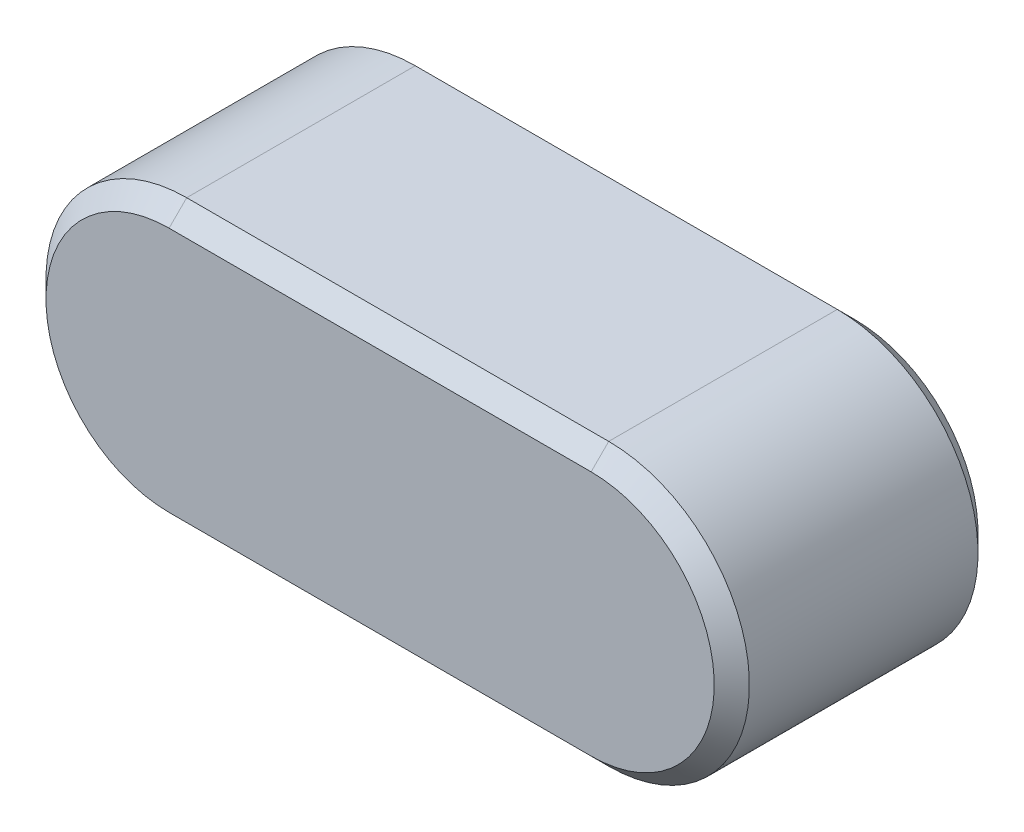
ISO-10303-21;
HEADER;
FILE_DESCRIPTION(('STEP AP214'),'2;1');
FILE_NAME('part.step','',(''),(''),'','','');
FILE_SCHEMA(('AUTOMOTIVE_DESIGN { 1 0 10303 214 1 1 1 1 }'));
ENDSEC;
DATA;
#1=APPLICATION_CONTEXT('core data for automotive mechanical design processes');
#2=APPLICATION_PROTOCOL_DEFINITION('international standard','automotive_design',2000,#1);
#3=PRODUCT_CONTEXT('',#1,'mechanical');
#4=PRODUCT('Part','Part','',(#3));
#5=PRODUCT_RELATED_PRODUCT_CATEGORY('part','',(#4));
#6=PRODUCT_DEFINITION_FORMATION('','',#4);
#7=PRODUCT_DEFINITION_CONTEXT('part definition',#1,'design');
#8=PRODUCT_DEFINITION('design','',#6,#7);
#9=PRODUCT_DEFINITION_SHAPE('','',#8);
#10=(LENGTH_UNIT() NAMED_UNIT(*) SI_UNIT(.MILLI.,.METRE.));
#11=(NAMED_UNIT(*) PLANE_ANGLE_UNIT() SI_UNIT($,.RADIAN.));
#12=(NAMED_UNIT(*) SI_UNIT($,.STERADIAN.) SOLID_ANGLE_UNIT());
#13=UNCERTAINTY_MEASURE_WITH_UNIT(LENGTH_MEASURE(1.E-05),#10,'distance_accuracy_value','');
#14=(GEOMETRIC_REPRESENTATION_CONTEXT(3) GLOBAL_UNCERTAINTY_ASSIGNED_CONTEXT((#13)) GLOBAL_UNIT_ASSIGNED_CONTEXT((#10,
#11,#12)) REPRESENTATION_CONTEXT('',''));
#15=CARTESIAN_POINT('',(0.,0.,0.));
#16=DIRECTION('',(0.,0.,1.));
#17=DIRECTION('',(1.,0.,0.));
#18=AXIS2_PLACEMENT_3D('',#15,#16,#17);
#19=CARTESIAN_POINT('',(-23.8409640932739,0.,7.5));
#20=DIRECTION('',(0.,0.,-1.));
#21=DIRECTION('',(-1.,0.,0.));
#22=AXIS2_PLACEMENT_3D('',#19,#20,#21);
#23=CYLINDRICAL_SURFACE('',#22,4.);
#24=DIRECTION('',(0.,0.,-1.));
#25=VECTOR('',#24,1.);
#26=CARTESIAN_POINT('',(-23.8409640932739,4.,7.5));
#27=LINE('',#26,#25);
#28=CARTESIAN_POINT('',(-23.8409640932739,4.,7.));
#29=VERTEX_POINT('',#28);
#30=CARTESIAN_POINT('',(-23.8409640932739,4.,0.500000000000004));
#31=VERTEX_POINT('',#30);
#32=EDGE_CURVE('E155',#29,#31,#27,.T.);
#33=ORIENTED_EDGE('',*,*,#32,.T.);
#34=CARTESIAN_POINT('',(-23.8409640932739,0.,0.500000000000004));
#35=DIRECTION('',(0.,0.,1.));
#36=DIRECTION('',(1.,0.,0.));
#37=AXIS2_PLACEMENT_3D('',#34,#35,#36);
#38=CIRCLE('',#37,4.);
#39=CARTESIAN_POINT('',(-23.8409640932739,-4.,0.500000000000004));
#40=VERTEX_POINT('',#39);
#41=EDGE_CURVE('E179',#31,#40,#38,.T.);
#42=ORIENTED_EDGE('',*,*,#41,.T.);
#43=DIRECTION('',(0.,0.,-1.));
#44=VECTOR('',#43,1.);
#45=CARTESIAN_POINT('',(-23.8409640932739,-4.,7.5));
#46=LINE('',#45,#44);
#47=CARTESIAN_POINT('',(-23.8409640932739,-4.,7.));
#48=VERTEX_POINT('',#47);
#49=EDGE_CURVE('E124',#48,#40,#46,.T.);
#50=ORIENTED_EDGE('',*,*,#49,.F.);
#51=CARTESIAN_POINT('',(-23.8409640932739,0.,7.));
#52=DIRECTION('',(0.,0.,1.));
#53=DIRECTION('',(1.,0.,0.));
#54=AXIS2_PLACEMENT_3D('',#51,#52,#53);
#55=CIRCLE('',#54,4.);
#56=EDGE_CURVE('E177',#48,#29,#55,.F.);
#57=ORIENTED_EDGE('',*,*,#56,.T.);
#58=EDGE_LOOP('',(#33,#42,#50,#57));
#59=FACE_BOUND('',#58,.T.);
#60=ADVANCED_FACE('F33',(#59),#23,.T.);
#61=CARTESIAN_POINT('',(-23.8409640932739,-4.,7.5));
#62=DIRECTION('',(0.,1.,0.));
#63=DIRECTION('',(-1.,0.,0.));
#64=AXIS2_PLACEMENT_3D('',#61,#62,#63);
#65=PLANE('',#64);
#66=ORIENTED_EDGE('',*,*,#49,.T.);
#67=DIRECTION('',(1.,0.,0.));
#68=VECTOR('',#67,1.);
#69=CARTESIAN_POINT('',(-23.8409640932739,-4.,0.500000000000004));
#70=LINE('',#69,#68);
#71=CARTESIAN_POINT('',(-11.8409640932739,-4.,0.500000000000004));
#72=VERTEX_POINT('',#71);
#73=EDGE_CURVE('E123',#40,#72,#70,.T.);
#74=ORIENTED_EDGE('',*,*,#73,.T.);
#75=DIRECTION('',(0.,0.,-1.));
#76=VECTOR('',#75,1.);
#77=CARTESIAN_POINT('',(-11.8409640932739,-4.,7.5));
#78=LINE('',#77,#76);
#79=CARTESIAN_POINT('',(-11.8409640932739,-4.,7.));
#80=VERTEX_POINT('',#79);
#81=EDGE_CURVE('E106',#80,#72,#78,.T.);
#82=ORIENTED_EDGE('',*,*,#81,.F.);
#83=DIRECTION('',(-1.,0.,0.));
#84=VECTOR('',#83,1.);
#85=CARTESIAN_POINT('',(-23.8409640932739,-4.,7.));
#86=LINE('',#85,#84);
#87=EDGE_CURVE('E120',#80,#48,#86,.T.);
#88=ORIENTED_EDGE('',*,*,#87,.T.);
#89=EDGE_LOOP('',(#66,#74,#82,#88));
#90=FACE_BOUND('',#89,.T.);
#91=ADVANCED_FACE('F119',(#90),#65,.F.);
#92=CARTESIAN_POINT('',(-11.8409640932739,0.,7.5));
#93=DIRECTION('',(0.,0.,-1.));
#94=DIRECTION('',(-1.,0.,0.));
#95=AXIS2_PLACEMENT_3D('',#92,#93,#94);
#96=CYLINDRICAL_SURFACE('',#95,4.);
#97=ORIENTED_EDGE('',*,*,#81,.T.);
#98=CARTESIAN_POINT('',(-11.8409640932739,0.,0.500000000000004));
#99=DIRECTION('',(0.,0.,1.));
#100=DIRECTION('',(1.,0.,0.));
#101=AXIS2_PLACEMENT_3D('',#98,#99,#100);
#102=CIRCLE('',#101,4.);
#103=CARTESIAN_POINT('',(-11.8409640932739,4.,0.500000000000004));
#104=VERTEX_POINT('',#103);
#105=EDGE_CURVE('E112',#72,#104,#102,.T.);
#106=ORIENTED_EDGE('',*,*,#105,.T.);
#107=DIRECTION('',(0.,0.,-1.));
#108=VECTOR('',#107,1.);
#109=CARTESIAN_POINT('',(-11.8409640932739,4.,7.5));
#110=LINE('',#109,#108);
#111=CARTESIAN_POINT('',(-11.8409640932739,4.,7.));
#112=VERTEX_POINT('',#111);
#113=EDGE_CURVE('E108',#112,#104,#110,.T.);
#114=ORIENTED_EDGE('',*,*,#113,.F.);
#115=CARTESIAN_POINT('',(-11.8409640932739,0.,7.));
#116=DIRECTION('',(0.,0.,1.));
#117=DIRECTION('',(1.,0.,0.));
#118=AXIS2_PLACEMENT_3D('',#115,#116,#117);
#119=CIRCLE('',#118,4.);
#120=EDGE_CURVE('E103',#112,#80,#119,.F.);
#121=ORIENTED_EDGE('',*,*,#120,.T.);
#122=EDGE_LOOP('',(#97,#106,#114,#121));
#123=FACE_BOUND('',#122,.T.);
#124=ADVANCED_FACE('F105',(#123),#96,.T.);
#125=CARTESIAN_POINT('',(-23.8409640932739,4.,7.5));
#126=DIRECTION('',(0.,-1.,0.));
#127=DIRECTION('',(1.,0.,0.));
#128=AXIS2_PLACEMENT_3D('',#125,#126,#127);
#129=PLANE('',#128);
#130=ORIENTED_EDGE('',*,*,#113,.T.);
#131=DIRECTION('',(-1.,0.,0.));
#132=VECTOR('',#131,1.);
#133=CARTESIAN_POINT('',(-23.8409640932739,4.,0.500000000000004));
#134=LINE('',#133,#132);
#135=EDGE_CURVE('E183',#104,#31,#134,.T.);
#136=ORIENTED_EDGE('',*,*,#135,.T.);
#137=ORIENTED_EDGE('',*,*,#32,.F.);
#138=DIRECTION('',(1.,0.,0.));
#139=VECTOR('',#138,1.);
#140=CARTESIAN_POINT('',(-11.8409640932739,4.,7.));
#141=LINE('',#140,#139);
#142=EDGE_CURVE('E181',#29,#112,#141,.T.);
#143=ORIENTED_EDGE('',*,*,#142,.T.);
#144=EDGE_LOOP('',(#130,#136,#137,#143));
#145=FACE_BOUND('',#144,.T.);
#146=ADVANCED_FACE('F193',(#145),#129,.F.);
#147=CARTESIAN_POINT('',(-23.8409640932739,0.,7.5));
#148=DIRECTION('',(0.,0.,1.));
#149=DIRECTION('',(1.,0.,0.));
#150=AXIS2_PLACEMENT_3D('',#147,#148,#149);
#151=PLANE('',#150);
#152=CARTESIAN_POINT('',(-23.8409640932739,0.,7.5));
#153=DIRECTION('',(0.,0.,1.));
#154=DIRECTION('',(1.,0.,0.));
#155=AXIS2_PLACEMENT_3D('',#152,#153,#154);
#156=CIRCLE('',#155,3.5);
#157=CARTESIAN_POINT('',(-23.8409640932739,3.5,7.5));
#158=VERTEX_POINT('',#157);
#159=CARTESIAN_POINT('',(-23.8409640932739,-3.5,7.5));
#160=VERTEX_POINT('',#159);
#161=EDGE_CURVE('E57',#158,#160,#156,.T.);
#162=ORIENTED_EDGE('',*,*,#161,.T.);
#163=DIRECTION('',(1.,0.,0.));
#164=VECTOR('',#163,1.);
#165=CARTESIAN_POINT('',(-11.8409640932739,-3.5,7.5));
#166=LINE('',#165,#164);
#167=CARTESIAN_POINT('',(-11.8409640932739,-3.5,7.5));
#168=VERTEX_POINT('',#167);
#169=EDGE_CURVE('E11',#160,#168,#166,.T.);
#170=ORIENTED_EDGE('',*,*,#169,.T.);
#171=CARTESIAN_POINT('',(-11.8409640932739,0.,7.5));
#172=DIRECTION('',(0.,0.,1.));
#173=DIRECTION('',(1.,0.,0.));
#174=AXIS2_PLACEMENT_3D('',#171,#172,#173);
#175=CIRCLE('',#174,3.5);
#176=CARTESIAN_POINT('',(-11.8409640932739,3.5,7.5));
#177=VERTEX_POINT('',#176);
#178=EDGE_CURVE('E42',#168,#177,#175,.T.);
#179=ORIENTED_EDGE('',*,*,#178,.T.);
#180=DIRECTION('',(-1.,0.,0.));
#181=VECTOR('',#180,1.);
#182=CARTESIAN_POINT('',(-23.8409640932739,3.5,7.5));
#183=LINE('',#182,#181);
#184=EDGE_CURVE('E185',#177,#158,#183,.T.);
#185=ORIENTED_EDGE('',*,*,#184,.T.);
#186=EDGE_LOOP('',(#162,#170,#179,#185));
#187=FACE_BOUND('',#186,.T.);
#188=ADVANCED_FACE('F188',(#187),#151,.T.);
#189=CARTESIAN_POINT('',(-23.8409640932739,0.,0.));
#190=DIRECTION('',(0.,0.,1.));
#191=DIRECTION('',(1.,0.,0.));
#192=AXIS2_PLACEMENT_3D('',#189,#190,#191);
#193=PLANE('',#192);
#194=CARTESIAN_POINT('',(-11.8409640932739,0.,0.));
#195=DIRECTION('',(0.,0.,1.));
#196=DIRECTION('',(1.,0.,0.));
#197=AXIS2_PLACEMENT_3D('',#194,#195,#196);
#198=CIRCLE('',#197,3.49999999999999);
#199=CARTESIAN_POINT('',(-11.8409640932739,3.49999999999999,0.));
#200=VERTEX_POINT('',#199);
#201=CARTESIAN_POINT('',(-11.8409640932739,-3.49999999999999,0.));
#202=VERTEX_POINT('',#201);
#203=EDGE_CURVE('E172',#200,#202,#198,.F.);
#204=ORIENTED_EDGE('',*,*,#203,.T.);
#205=DIRECTION('',(-1.,0.,0.));
#206=VECTOR('',#205,1.);
#207=CARTESIAN_POINT('',(-23.8409640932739,-3.5,0.));
#208=LINE('',#207,#206);
#209=CARTESIAN_POINT('',(-23.8409640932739,-3.5,0.));
#210=VERTEX_POINT('',#209);
#211=EDGE_CURVE('E113',#202,#210,#208,.T.);
#212=ORIENTED_EDGE('',*,*,#211,.T.);
#213=CARTESIAN_POINT('',(-23.8409640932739,0.,0.));
#214=DIRECTION('',(0.,0.,1.));
#215=DIRECTION('',(1.,0.,0.));
#216=AXIS2_PLACEMENT_3D('',#213,#214,#215);
#217=CIRCLE('',#216,3.5);
#218=CARTESIAN_POINT('',(-23.8409640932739,3.5,0.));
#219=VERTEX_POINT('',#218);
#220=EDGE_CURVE('E170',#210,#219,#217,.F.);
#221=ORIENTED_EDGE('',*,*,#220,.T.);
#222=DIRECTION('',(1.,0.,0.));
#223=VECTOR('',#222,1.);
#224=CARTESIAN_POINT('',(-23.8409640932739,3.5,0.));
#225=LINE('',#224,#223);
#226=EDGE_CURVE('E168',#219,#200,#225,.T.);
#227=ORIENTED_EDGE('',*,*,#226,.T.);
#228=EDGE_LOOP('',(#204,#212,#221,#227));
#229=FACE_BOUND('',#228,.T.);
#230=ADVANCED_FACE('F220',(#229),#193,.F.);
#231=CARTESIAN_POINT('',(-23.8409640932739,4.,0.500000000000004));
#232=DIRECTION('',(0.,-0.707106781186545,0.70710678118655));
#233=DIRECTION('',(0.,-0.70710678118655,-0.707106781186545));
#234=AXIS2_PLACEMENT_3D('',#231,#232,#233);
#235=PLANE('',#234);
#236=DIRECTION('',(0.,0.70710678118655,0.707106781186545));
#237=VECTOR('',#236,1.);
#238=CARTESIAN_POINT('',(-11.8409640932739,3.49999999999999,0.));
#239=LINE('',#238,#237);
#240=EDGE_CURVE('E147',#200,#104,#239,.T.);
#241=ORIENTED_EDGE('',*,*,#240,.F.);
#242=ORIENTED_EDGE('',*,*,#226,.F.);
#243=DIRECTION('',(0.,-0.70710678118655,-0.707106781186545));
#244=VECTOR('',#243,1.);
#245=CARTESIAN_POINT('',(-23.8409640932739,4.,0.500000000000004));
#246=LINE('',#245,#244);
#247=EDGE_CURVE('E135',#31,#219,#246,.T.);
#248=ORIENTED_EDGE('',*,*,#247,.F.);
#249=ORIENTED_EDGE('',*,*,#135,.F.);
#250=EDGE_LOOP('',(#241,#242,#248,#249));
#251=FACE_BOUND('',#250,.T.);
#252=ADVANCED_FACE('F196',(#251),#235,.F.);
#253=CARTESIAN_POINT('',(-23.8409640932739,0.,0.500000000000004));
#254=DIRECTION('',(0.,0.,1.));
#255=DIRECTION('',(1.,0.,0.));
#256=AXIS2_PLACEMENT_3D('',#253,#254,#255);
#257=CONICAL_SURFACE('',#256,4.,0.785398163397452);
#258=ORIENTED_EDGE('',*,*,#247,.T.);
#259=ORIENTED_EDGE('',*,*,#220,.F.);
#260=DIRECTION('',(0.,0.70710678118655,-0.707106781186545));
#261=VECTOR('',#260,1.);
#262=CARTESIAN_POINT('',(-23.8409640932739,-4.,0.500000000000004));
#263=LINE('',#262,#261);
#264=EDGE_CURVE('E141',#40,#210,#263,.T.);
#265=ORIENTED_EDGE('',*,*,#264,.F.);
#266=ORIENTED_EDGE('',*,*,#41,.F.);
#267=EDGE_LOOP('',(#258,#259,#265,#266));
#268=FACE_BOUND('',#267,.T.);
#269=ADVANCED_FACE('F199',(#268),#257,.T.);
#270=CARTESIAN_POINT('',(-11.8409640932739,0.,0.500000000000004));
#271=DIRECTION('',(0.,0.,1.));
#272=DIRECTION('',(1.,0.,0.));
#273=AXIS2_PLACEMENT_3D('',#270,#271,#272);
#274=CONICAL_SURFACE('',#273,4.,0.785398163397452);
#275=ORIENTED_EDGE('',*,*,#240,.T.);
#276=ORIENTED_EDGE('',*,*,#105,.F.);
#277=DIRECTION('',(0.,-0.70710678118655,0.707106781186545));
#278=VECTOR('',#277,1.);
#279=CARTESIAN_POINT('',(-11.8409640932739,-3.49999999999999,0.));
#280=LINE('',#279,#278);
#281=EDGE_CURVE('E138',#202,#72,#280,.T.);
#282=ORIENTED_EDGE('',*,*,#281,.F.);
#283=ORIENTED_EDGE('',*,*,#203,.F.);
#284=EDGE_LOOP('',(#275,#276,#282,#283));
#285=FACE_BOUND('',#284,.T.);
#286=ADVANCED_FACE('F202',(#285),#274,.T.);
#287=CARTESIAN_POINT('',(-23.8409640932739,-4.,0.500000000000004));
#288=DIRECTION('',(0.,0.707106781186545,0.70710678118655));
#289=DIRECTION('',(0.,-0.70710678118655,0.707106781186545));
#290=AXIS2_PLACEMENT_3D('',#287,#288,#289);
#291=PLANE('',#290);
#292=ORIENTED_EDGE('',*,*,#264,.T.);
#293=ORIENTED_EDGE('',*,*,#211,.F.);
#294=ORIENTED_EDGE('',*,*,#281,.T.);
#295=ORIENTED_EDGE('',*,*,#73,.F.);
#296=EDGE_LOOP('',(#292,#293,#294,#295));
#297=FACE_BOUND('',#296,.T.);
#298=ADVANCED_FACE('F200',(#297),#291,.F.);
#299=CARTESIAN_POINT('',(-23.8409640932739,3.5,7.5));
#300=DIRECTION('',(0.,0.707106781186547,0.707106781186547));
#301=DIRECTION('',(0.,-0.707106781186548,0.707106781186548));
#302=AXIS2_PLACEMENT_3D('',#299,#300,#301);
#303=PLANE('',#302);
#304=DIRECTION('',(0.,-0.707106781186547,0.707106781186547));
#305=VECTOR('',#304,1.);
#306=CARTESIAN_POINT('',(-11.8409640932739,4.,7.));
#307=LINE('',#306,#305);
#308=EDGE_CURVE('E132',#112,#177,#307,.T.);
#309=ORIENTED_EDGE('',*,*,#308,.F.);
#310=ORIENTED_EDGE('',*,*,#142,.F.);
#311=DIRECTION('',(0.,0.707106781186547,-0.707106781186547));
#312=VECTOR('',#311,1.);
#313=CARTESIAN_POINT('',(-23.8409640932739,3.5,7.5));
#314=LINE('',#313,#312);
#315=EDGE_CURVE('E37',#158,#29,#314,.T.);
#316=ORIENTED_EDGE('',*,*,#315,.F.);
#317=ORIENTED_EDGE('',*,*,#184,.F.);
#318=EDGE_LOOP('',(#309,#310,#316,#317));
#319=FACE_BOUND('',#318,.T.);
#320=ADVANCED_FACE('F35',(#319),#303,.T.);
#321=CARTESIAN_POINT('',(-23.8409640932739,0.,7.5));
#322=DIRECTION('',(0.,0.,-1.));
#323=DIRECTION('',(-1.,0.,0.));
#324=AXIS2_PLACEMENT_3D('',#321,#322,#323);
#325=CONICAL_SURFACE('',#324,3.5,0.785398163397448);
#326=ORIENTED_EDGE('',*,*,#315,.T.);
#327=ORIENTED_EDGE('',*,*,#56,.F.);
#328=DIRECTION('',(0.,-0.707106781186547,-0.707106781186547));
#329=VECTOR('',#328,1.);
#330=CARTESIAN_POINT('',(-23.8409640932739,-3.5,7.5));
#331=LINE('',#330,#329);
#332=EDGE_CURVE('E127',#160,#48,#331,.T.);
#333=ORIENTED_EDGE('',*,*,#332,.F.);
#334=ORIENTED_EDGE('',*,*,#161,.F.);
#335=EDGE_LOOP('',(#326,#327,#333,#334));
#336=FACE_BOUND('',#335,.T.);
#337=ADVANCED_FACE('F191',(#336),#325,.T.);
#338=CARTESIAN_POINT('',(-11.8409640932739,0.,7.5));
#339=DIRECTION('',(0.,0.,-1.));
#340=DIRECTION('',(-1.,0.,0.));
#341=AXIS2_PLACEMENT_3D('',#338,#339,#340);
#342=CONICAL_SURFACE('',#341,3.5,0.785398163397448);
#343=ORIENTED_EDGE('',*,*,#308,.T.);
#344=ORIENTED_EDGE('',*,*,#178,.F.);
#345=DIRECTION('',(0.,0.707106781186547,0.707106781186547));
#346=VECTOR('',#345,1.);
#347=CARTESIAN_POINT('',(-11.8409640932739,-4.,7.));
#348=LINE('',#347,#346);
#349=EDGE_CURVE('E50',#80,#168,#348,.T.);
#350=ORIENTED_EDGE('',*,*,#349,.F.);
#351=ORIENTED_EDGE('',*,*,#120,.F.);
#352=EDGE_LOOP('',(#343,#344,#350,#351));
#353=FACE_BOUND('',#352,.T.);
#354=ADVANCED_FACE('F130',(#353),#342,.T.);
#355=CARTESIAN_POINT('',(-23.8409640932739,-3.5,7.5));
#356=DIRECTION('',(0.,-0.707106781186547,0.707106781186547));
#357=DIRECTION('',(0.,-0.707106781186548,-0.707106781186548));
#358=AXIS2_PLACEMENT_3D('',#355,#356,#357);
#359=PLANE('',#358);
#360=ORIENTED_EDGE('',*,*,#332,.T.);
#361=ORIENTED_EDGE('',*,*,#87,.F.);
#362=ORIENTED_EDGE('',*,*,#349,.T.);
#363=ORIENTED_EDGE('',*,*,#169,.F.);
#364=EDGE_LOOP('',(#360,#361,#362,#363));
#365=FACE_BOUND('',#364,.T.);
#366=ADVANCED_FACE('F126',(#365),#359,.T.);
#367=CLOSED_SHELL('',(#60,#91,#124,#146,#188,#230,#252,#269,#286,#298,#320,#337,#354,#366));
#368=MANIFOLD_SOLID_BREP('B2',#367);
#369=ADVANCED_BREP_SHAPE_REPRESENTATION('',(#18,#368),#14);
#370=SHAPE_DEFINITION_REPRESENTATION(#9,#369);
ENDSEC;
END-ISO-10303-21;
